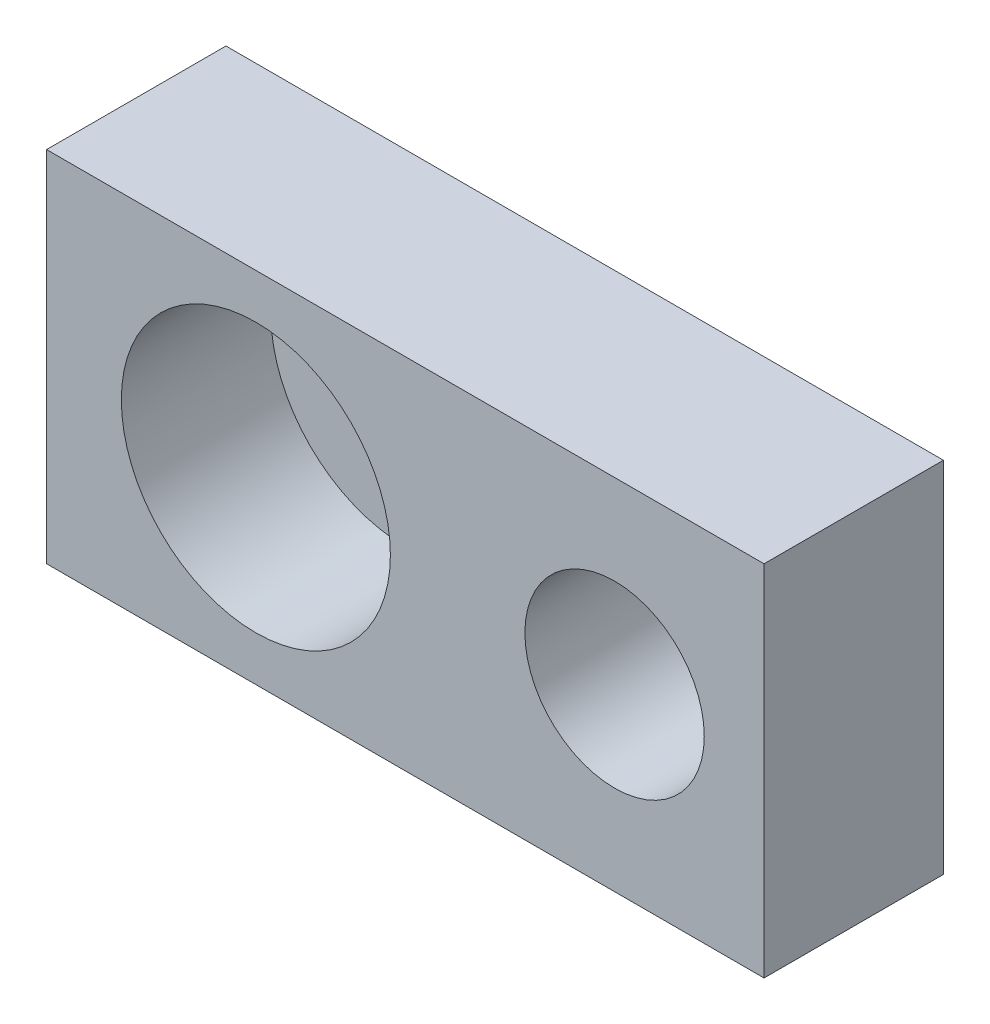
ISO-10303-21;
HEADER;
FILE_DESCRIPTION(('STEP AP214'),'2;1');
FILE_NAME('part.step','',(''),(''),'','','');
FILE_SCHEMA(('AUTOMOTIVE_DESIGN { 1 0 10303 214 1 1 1 1 }'));
ENDSEC;
DATA;
#1=APPLICATION_CONTEXT('core data for automotive mechanical design processes');
#2=APPLICATION_PROTOCOL_DEFINITION('international standard','automotive_design',2000,#1);
#3=PRODUCT_CONTEXT('',#1,'mechanical');
#4=PRODUCT('Part','Part','',(#3));
#5=PRODUCT_RELATED_PRODUCT_CATEGORY('part','',(#4));
#6=PRODUCT_DEFINITION_FORMATION('','',#4);
#7=PRODUCT_DEFINITION_CONTEXT('part definition',#1,'design');
#8=PRODUCT_DEFINITION('design','',#6,#7);
#9=PRODUCT_DEFINITION_SHAPE('','',#8);
#10=(LENGTH_UNIT() NAMED_UNIT(*) SI_UNIT(.MILLI.,.METRE.));
#11=(NAMED_UNIT(*) PLANE_ANGLE_UNIT() SI_UNIT($,.RADIAN.));
#12=(NAMED_UNIT(*) SI_UNIT($,.STERADIAN.) SOLID_ANGLE_UNIT());
#13=UNCERTAINTY_MEASURE_WITH_UNIT(LENGTH_MEASURE(1.E-05),#10,'distance_accuracy_value','');
#14=(GEOMETRIC_REPRESENTATION_CONTEXT(3) GLOBAL_UNCERTAINTY_ASSIGNED_CONTEXT((#13)) GLOBAL_UNIT_ASSIGNED_CONTEXT((#10,
#11,#12)) REPRESENTATION_CONTEXT('',''));
#15=CARTESIAN_POINT('',(0.,0.,0.));
#16=DIRECTION('',(0.,0.,1.));
#17=DIRECTION('',(1.,0.,0.));
#18=AXIS2_PLACEMENT_3D('',#15,#16,#17);
#19=CARTESIAN_POINT('',(-5.,0.,6.));
#20=DIRECTION('',(0.,0.,-1.));
#21=DIRECTION('',(-1.,0.,0.));
#22=AXIS2_PLACEMENT_3D('',#19,#20,#21);
#23=CYLINDRICAL_SURFACE('',#22,4.5);
#24=CARTESIAN_POINT('',(-5.,0.,6.));
#25=DIRECTION('',(0.,0.,1.));
#26=DIRECTION('',(1.,0.,0.));
#27=AXIS2_PLACEMENT_3D('',#24,#25,#26);
#28=CIRCLE('',#27,4.5);
#29=CARTESIAN_POINT('',(-0.5,0.,6.));
#30=VERTEX_POINT('',#29);
#31=EDGE_CURVE('E86',#30,#30,#28,.T.);
#32=ORIENTED_EDGE('',*,*,#31,.T.);
#33=EDGE_LOOP('',(#32));
#34=FACE_BOUND('',#33,.T.);
#35=CARTESIAN_POINT('',(-5.,0.,1.));
#36=DIRECTION('',(0.,0.,-1.));
#37=DIRECTION('',(-1.,0.,0.));
#38=AXIS2_PLACEMENT_3D('',#35,#36,#37);
#39=CIRCLE('',#38,4.5);
#40=CARTESIAN_POINT('',(-9.5,0.,1.));
#41=VERTEX_POINT('',#40);
#42=EDGE_CURVE('E101',#41,#41,#39,.T.);
#43=ORIENTED_EDGE('',*,*,#42,.T.);
#44=EDGE_LOOP('',(#43));
#45=FACE_BOUND('',#44,.T.);
#46=ADVANCED_FACE('F18',(#34,#45),#23,.F.);
#47=CARTESIAN_POINT('',(7.,0.,6.));
#48=DIRECTION('',(0.,0.,-1.));
#49=DIRECTION('',(-1.,0.,0.));
#50=AXIS2_PLACEMENT_3D('',#47,#48,#49);
#51=CYLINDRICAL_SURFACE('',#50,3.);
#52=CARTESIAN_POINT('',(7.,0.,6.));
#53=DIRECTION('',(0.,0.,1.));
#54=DIRECTION('',(1.,0.,0.));
#55=AXIS2_PLACEMENT_3D('',#52,#53,#54);
#56=CIRCLE('',#55,3.);
#57=CARTESIAN_POINT('',(10.,0.,6.));
#58=VERTEX_POINT('',#57);
#59=EDGE_CURVE('E98',#58,#58,#56,.T.);
#60=ORIENTED_EDGE('',*,*,#59,.T.);
#61=EDGE_LOOP('',(#60));
#62=FACE_BOUND('',#61,.T.);
#63=CARTESIAN_POINT('',(7.,0.,1.));
#64=DIRECTION('',(0.,0.,-1.));
#65=DIRECTION('',(-1.,0.,0.));
#66=AXIS2_PLACEMENT_3D('',#63,#64,#65);
#67=CIRCLE('',#66,3.);
#68=CARTESIAN_POINT('',(4.,0.,1.));
#69=VERTEX_POINT('',#68);
#70=EDGE_CURVE('E22',#69,#69,#67,.T.);
#71=ORIENTED_EDGE('',*,*,#70,.T.);
#72=EDGE_LOOP('',(#71));
#73=FACE_BOUND('',#72,.T.);
#74=ADVANCED_FACE('F108',(#62,#73),#51,.F.);
#75=CARTESIAN_POINT('',(0.,0.,6.));
#76=DIRECTION('',(0.,0.,1.));
#77=DIRECTION('',(1.,0.,0.));
#78=AXIS2_PLACEMENT_3D('',#75,#76,#77);
#79=PLANE('',#78);
#80=ORIENTED_EDGE('',*,*,#31,.F.);
#81=EDGE_LOOP('',(#80));
#82=FACE_BOUND('',#81,.T.);
#83=DIRECTION('',(0.,1.,0.));
#84=VECTOR('',#83,1.);
#85=CARTESIAN_POINT('',(12.,6.,6.));
#86=LINE('',#85,#84);
#87=CARTESIAN_POINT('',(12.,-6.,6.));
#88=VERTEX_POINT('',#87);
#89=CARTESIAN_POINT('',(12.,6.,6.));
#90=VERTEX_POINT('',#89);
#91=EDGE_CURVE('E69',#88,#90,#86,.T.);
#92=ORIENTED_EDGE('',*,*,#91,.T.);
#93=DIRECTION('',(-1.,0.,0.));
#94=VECTOR('',#93,1.);
#95=CARTESIAN_POINT('',(-12.,6.,6.));
#96=LINE('',#95,#94);
#97=CARTESIAN_POINT('',(-12.,6.,6.));
#98=VERTEX_POINT('',#97);
#99=EDGE_CURVE('E64',#90,#98,#96,.T.);
#100=ORIENTED_EDGE('',*,*,#99,.T.);
#101=DIRECTION('',(0.,-1.,0.));
#102=VECTOR('',#101,1.);
#103=CARTESIAN_POINT('',(-12.,6.,6.));
#104=LINE('',#103,#102);
#105=CARTESIAN_POINT('',(-12.,-6.,6.));
#106=VERTEX_POINT('',#105);
#107=EDGE_CURVE('E68',#98,#106,#104,.T.);
#108=ORIENTED_EDGE('',*,*,#107,.T.);
#109=DIRECTION('',(1.,0.,0.));
#110=VECTOR('',#109,1.);
#111=CARTESIAN_POINT('',(-12.,-6.,6.));
#112=LINE('',#111,#110);
#113=EDGE_CURVE('E36',#106,#88,#112,.T.);
#114=ORIENTED_EDGE('',*,*,#113,.T.);
#115=EDGE_LOOP('',(#92,#100,#108,#114));
#116=FACE_BOUND('',#115,.T.);
#117=ORIENTED_EDGE('',*,*,#59,.F.);
#118=EDGE_LOOP('',(#117));
#119=FACE_BOUND('',#118,.T.);
#120=ADVANCED_FACE('F65',(#82,#116,#119),#79,.T.);
#121=CARTESIAN_POINT('',(0.,0.,0.));
#122=DIRECTION('',(0.,0.,1.));
#123=DIRECTION('',(1.,0.,0.));
#124=AXIS2_PLACEMENT_3D('',#121,#122,#123);
#125=PLANE('',#124);
#126=DIRECTION('',(0.,1.,0.));
#127=VECTOR('',#126,1.);
#128=CARTESIAN_POINT('',(12.,6.,0.));
#129=LINE('',#128,#127);
#130=CARTESIAN_POINT('',(12.,-6.,0.));
#131=VERTEX_POINT('',#130);
#132=CARTESIAN_POINT('',(12.,6.,0.));
#133=VERTEX_POINT('',#132);
#134=EDGE_CURVE('E84',#131,#133,#129,.T.);
#135=ORIENTED_EDGE('',*,*,#134,.F.);
#136=DIRECTION('',(1.,0.,0.));
#137=VECTOR('',#136,1.);
#138=CARTESIAN_POINT('',(-12.,-6.,0.));
#139=LINE('',#138,#137);
#140=CARTESIAN_POINT('',(-12.,-6.,0.));
#141=VERTEX_POINT('',#140);
#142=EDGE_CURVE('E90',#141,#131,#139,.T.);
#143=ORIENTED_EDGE('',*,*,#142,.F.);
#144=DIRECTION('',(0.,-1.,0.));
#145=VECTOR('',#144,1.);
#146=CARTESIAN_POINT('',(-12.,6.,0.));
#147=LINE('',#146,#145);
#148=CARTESIAN_POINT('',(-12.,6.,0.));
#149=VERTEX_POINT('',#148);
#150=EDGE_CURVE('E88',#149,#141,#147,.T.);
#151=ORIENTED_EDGE('',*,*,#150,.F.);
#152=DIRECTION('',(-1.,0.,0.));
#153=VECTOR('',#152,1.);
#154=CARTESIAN_POINT('',(-12.,6.,0.));
#155=LINE('',#154,#153);
#156=EDGE_CURVE('E75',#133,#149,#155,.T.);
#157=ORIENTED_EDGE('',*,*,#156,.F.);
#158=EDGE_LOOP('',(#135,#143,#151,#157));
#159=FACE_BOUND('',#158,.T.);
#160=ADVANCED_FACE('F135',(#159),#125,.F.);
#161=CARTESIAN_POINT('',(12.,6.,6.));
#162=DIRECTION('',(-1.,0.,0.));
#163=DIRECTION('',(0.,-1.,0.));
#164=AXIS2_PLACEMENT_3D('',#161,#162,#163);
#165=PLANE('',#164);
#166=ORIENTED_EDGE('',*,*,#134,.T.);
#167=DIRECTION('',(0.,0.,-1.));
#168=VECTOR('',#167,1.);
#169=CARTESIAN_POINT('',(12.,6.,6.));
#170=LINE('',#169,#168);
#171=EDGE_CURVE('E11',#90,#133,#170,.T.);
#172=ORIENTED_EDGE('',*,*,#171,.F.);
#173=ORIENTED_EDGE('',*,*,#91,.F.);
#174=DIRECTION('',(0.,0.,-1.));
#175=VECTOR('',#174,1.);
#176=CARTESIAN_POINT('',(12.,-6.,6.));
#177=LINE('',#176,#175);
#178=EDGE_CURVE('E58',#88,#131,#177,.T.);
#179=ORIENTED_EDGE('',*,*,#178,.T.);
#180=EDGE_LOOP('',(#166,#172,#173,#179));
#181=FACE_BOUND('',#180,.T.);
#182=ADVANCED_FACE('F20',(#181),#165,.F.);
#183=CARTESIAN_POINT('',(-12.,6.,6.));
#184=DIRECTION('',(0.,-1.,0.));
#185=DIRECTION('',(0.,0.,-1.));
#186=AXIS2_PLACEMENT_3D('',#183,#184,#185);
#187=PLANE('',#186);
#188=ORIENTED_EDGE('',*,*,#156,.T.);
#189=DIRECTION('',(0.,0.,-1.));
#190=VECTOR('',#189,1.);
#191=CARTESIAN_POINT('',(-12.,6.,6.));
#192=LINE('',#191,#190);
#193=EDGE_CURVE('E28',#98,#149,#192,.T.);
#194=ORIENTED_EDGE('',*,*,#193,.F.);
#195=ORIENTED_EDGE('',*,*,#99,.F.);
#196=ORIENTED_EDGE('',*,*,#171,.T.);
#197=EDGE_LOOP('',(#188,#194,#195,#196));
#198=FACE_BOUND('',#197,.T.);
#199=ADVANCED_FACE('F73',(#198),#187,.F.);
#200=CARTESIAN_POINT('',(-12.,6.,6.));
#201=DIRECTION('',(1.,0.,0.));
#202=DIRECTION('',(0.,1.,0.));
#203=AXIS2_PLACEMENT_3D('',#200,#201,#202);
#204=PLANE('',#203);
#205=ORIENTED_EDGE('',*,*,#150,.T.);
#206=DIRECTION('',(0.,0.,-1.));
#207=VECTOR('',#206,1.);
#208=CARTESIAN_POINT('',(-12.,-6.,6.));
#209=LINE('',#208,#207);
#210=EDGE_CURVE('E51',#106,#141,#209,.T.);
#211=ORIENTED_EDGE('',*,*,#210,.F.);
#212=ORIENTED_EDGE('',*,*,#107,.F.);
#213=ORIENTED_EDGE('',*,*,#193,.T.);
#214=EDGE_LOOP('',(#205,#211,#212,#213));
#215=FACE_BOUND('',#214,.T.);
#216=ADVANCED_FACE('F79',(#215),#204,.F.);
#217=CARTESIAN_POINT('',(-12.,-6.,6.));
#218=DIRECTION('',(0.,1.,0.));
#219=DIRECTION('',(0.,0.,1.));
#220=AXIS2_PLACEMENT_3D('',#217,#218,#219);
#221=PLANE('',#220);
#222=ORIENTED_EDGE('',*,*,#142,.T.);
#223=ORIENTED_EDGE('',*,*,#178,.F.);
#224=ORIENTED_EDGE('',*,*,#113,.F.);
#225=ORIENTED_EDGE('',*,*,#210,.T.);
#226=EDGE_LOOP('',(#222,#223,#224,#225));
#227=FACE_BOUND('',#226,.T.);
#228=ADVANCED_FACE('F113',(#227),#221,.F.);
#229=CARTESIAN_POINT('',(0.,0.,1.));
#230=DIRECTION('',(0.,0.,-1.));
#231=DIRECTION('',(-1.,0.,0.));
#232=AXIS2_PLACEMENT_3D('',#229,#230,#231);
#233=PLANE('',#232);
#234=ORIENTED_EDGE('',*,*,#70,.F.);
#235=EDGE_LOOP('',(#234));
#236=FACE_BOUND('',#235,.T.);
#237=ADVANCED_FACE('F110',(#236),#233,.F.);
#238=ORIENTED_EDGE('',*,*,#42,.F.);
#239=EDGE_LOOP('',(#238));
#240=FACE_BOUND('',#239,.T.);
#241=ADVANCED_FACE('F112',(#240),#233,.F.);
#242=CLOSED_SHELL('',(#46,#74,#120,#160,#182,#199,#216,#228,#237,#241));
#243=MANIFOLD_SOLID_BREP('B1',#242);
#244=ADVANCED_BREP_SHAPE_REPRESENTATION('',(#18,#243),#14);
#245=SHAPE_DEFINITION_REPRESENTATION(#9,#244);
ENDSEC;
END-ISO-10303-21;
